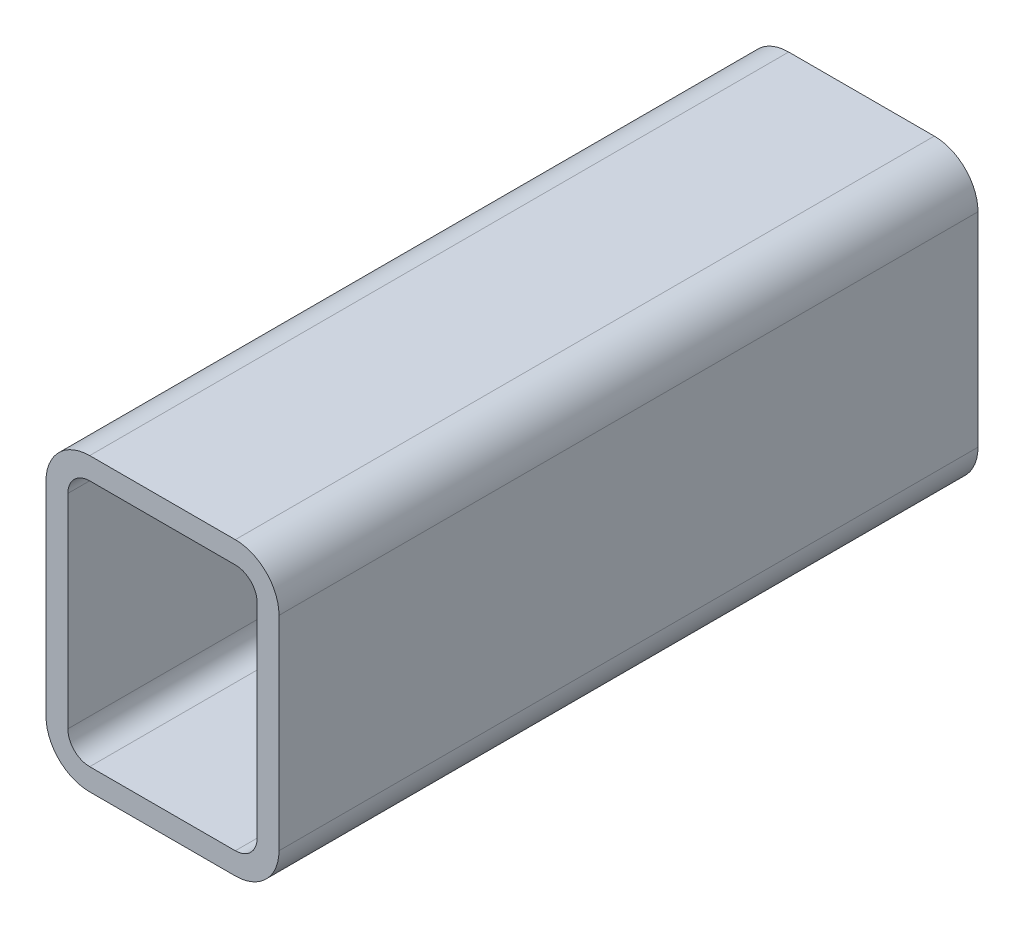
ISO-10303-21;
HEADER;
FILE_DESCRIPTION(('STEP AP214'),'2;1');
FILE_NAME('part.step','',(''),(''),'','','');
FILE_SCHEMA(('AUTOMOTIVE_DESIGN { 1 0 10303 214 1 1 1 1 }'));
ENDSEC;
DATA;
#1=APPLICATION_CONTEXT('core data for automotive mechanical design processes');
#2=APPLICATION_PROTOCOL_DEFINITION('international standard','automotive_design',2000,#1);
#3=PRODUCT_CONTEXT('',#1,'mechanical');
#4=PRODUCT('Part','Part','',(#3));
#5=PRODUCT_RELATED_PRODUCT_CATEGORY('part','',(#4));
#6=PRODUCT_DEFINITION_FORMATION('','',#4);
#7=PRODUCT_DEFINITION_CONTEXT('part definition',#1,'design');
#8=PRODUCT_DEFINITION('design','',#6,#7);
#9=PRODUCT_DEFINITION_SHAPE('','',#8);
#10=(LENGTH_UNIT() NAMED_UNIT(*) SI_UNIT(.MILLI.,.METRE.));
#11=(NAMED_UNIT(*) PLANE_ANGLE_UNIT() SI_UNIT($,.RADIAN.));
#12=(NAMED_UNIT(*) SI_UNIT($,.STERADIAN.) SOLID_ANGLE_UNIT());
#13=UNCERTAINTY_MEASURE_WITH_UNIT(LENGTH_MEASURE(1.E-05),#10,'distance_accuracy_value','');
#14=(GEOMETRIC_REPRESENTATION_CONTEXT(3) GLOBAL_UNCERTAINTY_ASSIGNED_CONTEXT((#13)) GLOBAL_UNIT_ASSIGNED_CONTEXT((#10,
#11,#12)) REPRESENTATION_CONTEXT('',''));
#15=CARTESIAN_POINT('',(0.,0.,0.));
#16=DIRECTION('',(0.,0.,1.));
#17=DIRECTION('',(1.,0.,0.));
#18=AXIS2_PLACEMENT_3D('',#15,#16,#17);
#19=CARTESIAN_POINT('',(20.7251778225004,109.98485662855,304.8));
#20=DIRECTION('',(0.,0.,1.));
#21=DIRECTION('',(1.,0.,0.));
#22=AXIS2_PLACEMENT_3D('',#19,#20,#21);
#23=PLANE('',#22);
#24=CARTESIAN_POINT('',(20.7251778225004,109.98485662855,304.8));
#25=DIRECTION('',(0.,0.,1.));
#26=DIRECTION('',(1.,0.,0.));
#27=AXIS2_PLACEMENT_3D('',#24,#25,#26);
#28=CIRCLE('',#27,19.05);
#29=CARTESIAN_POINT('',(20.7251778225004,129.03485662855,304.8));
#30=VERTEX_POINT('',#29);
#31=CARTESIAN_POINT('',(1.67517782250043,109.98485662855,304.8));
#32=VERTEX_POINT('',#31);
#33=EDGE_CURVE('E211',#30,#32,#28,.T.);
#34=ORIENTED_EDGE('',*,*,#33,.T.);
#35=DIRECTION('',(0.,-1.,0.));
#36=VECTOR('',#35,1.);
#37=CARTESIAN_POINT('',(1.67517782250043,21.08485662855,304.8));
#38=LINE('',#37,#36);
#39=CARTESIAN_POINT('',(1.67517782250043,21.08485662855,304.8));
#40=VERTEX_POINT('',#39);
#41=EDGE_CURVE('E214',#32,#40,#38,.T.);
#42=ORIENTED_EDGE('',*,*,#41,.T.);
#43=CARTESIAN_POINT('',(20.7251778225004,21.08485662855,304.8));
#44=DIRECTION('',(0.,0.,1.));
#45=DIRECTION('',(1.,0.,0.));
#46=AXIS2_PLACEMENT_3D('',#43,#44,#45);
#47=CIRCLE('',#46,19.05);
#48=CARTESIAN_POINT('',(20.7251778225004,2.03485662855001,304.8));
#49=VERTEX_POINT('',#48);
#50=EDGE_CURVE('E217',#40,#49,#47,.T.);
#51=ORIENTED_EDGE('',*,*,#50,.T.);
#52=DIRECTION('',(1.,0.,0.));
#53=VECTOR('',#52,1.);
#54=CARTESIAN_POINT('',(84.2251778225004,2.03485662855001,304.8));
#55=LINE('',#54,#53);
#56=CARTESIAN_POINT('',(84.2251778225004,2.03485662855,304.8));
#57=VERTEX_POINT('',#56);
#58=EDGE_CURVE('E219',#49,#57,#55,.T.);
#59=ORIENTED_EDGE('',*,*,#58,.T.);
#60=CARTESIAN_POINT('',(84.2251778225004,21.08485662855,304.8));
#61=DIRECTION('',(0.,0.,1.));
#62=DIRECTION('',(1.,0.,0.));
#63=AXIS2_PLACEMENT_3D('',#60,#61,#62);
#64=CIRCLE('',#63,19.05);
#65=CARTESIAN_POINT('',(103.2751778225,21.08485662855,304.8));
#66=VERTEX_POINT('',#65);
#67=EDGE_CURVE('E221',#57,#66,#64,.T.);
#68=ORIENTED_EDGE('',*,*,#67,.T.);
#69=DIRECTION('',(0.,1.,0.));
#70=VECTOR('',#69,1.);
#71=CARTESIAN_POINT('',(103.2751778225,109.98485662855,304.8));
#72=LINE('',#71,#70);
#73=CARTESIAN_POINT('',(103.2751778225,109.98485662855,304.8));
#74=VERTEX_POINT('',#73);
#75=EDGE_CURVE('E223',#66,#74,#72,.T.);
#76=ORIENTED_EDGE('',*,*,#75,.T.);
#77=CARTESIAN_POINT('',(84.2251778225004,109.98485662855,304.8));
#78=DIRECTION('',(0.,0.,1.));
#79=DIRECTION('',(1.,0.,0.));
#80=AXIS2_PLACEMENT_3D('',#77,#78,#79);
#81=CIRCLE('',#80,19.05);
#82=CARTESIAN_POINT('',(84.2251778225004,129.03485662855,304.8));
#83=VERTEX_POINT('',#82);
#84=EDGE_CURVE('E225',#74,#83,#81,.T.);
#85=ORIENTED_EDGE('',*,*,#84,.T.);
#86=DIRECTION('',(-1.,0.,0.));
#87=VECTOR('',#86,1.);
#88=CARTESIAN_POINT('',(20.7251778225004,129.03485662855,304.8));
#89=LINE('',#88,#87);
#90=EDGE_CURVE('E227',#83,#30,#89,.T.);
#91=ORIENTED_EDGE('',*,*,#90,.T.);
#92=EDGE_LOOP('',(#34,#42,#51,#59,#68,#76,#85,#91));
#93=FACE_BOUND('',#92,.T.);
#94=DIRECTION('',(0.,-1.,0.));
#95=VECTOR('',#94,1.);
#96=CARTESIAN_POINT('',(11.2001778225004,21.08485662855,304.8));
#97=LINE('',#96,#95);
#98=CARTESIAN_POINT('',(11.2001778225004,109.98485662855,304.8));
#99=VERTEX_POINT('',#98);
#100=CARTESIAN_POINT('',(11.2001778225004,21.08485662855,304.8));
#101=VERTEX_POINT('',#100);
#102=EDGE_CURVE('E154',#99,#101,#97,.T.);
#103=ORIENTED_EDGE('',*,*,#102,.F.);
#104=CARTESIAN_POINT('',(20.7251778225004,109.98485662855,304.8));
#105=DIRECTION('',(0.,0.,1.));
#106=DIRECTION('',(1.,0.,0.));
#107=AXIS2_PLACEMENT_3D('',#104,#105,#106);
#108=CIRCLE('',#107,9.525);
#109=CARTESIAN_POINT('',(20.7251778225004,119.50985662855,304.8));
#110=VERTEX_POINT('',#109);
#111=EDGE_CURVE('E146',#110,#99,#108,.T.);
#112=ORIENTED_EDGE('',*,*,#111,.F.);
#113=DIRECTION('',(-1.,0.,0.));
#114=VECTOR('',#113,1.);
#115=CARTESIAN_POINT('',(20.7251778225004,119.50985662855,304.8));
#116=LINE('',#115,#114);
#117=CARTESIAN_POINT('',(84.2251778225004,119.50985662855,304.8));
#118=VERTEX_POINT('',#117);
#119=EDGE_CURVE('E179',#118,#110,#116,.T.);
#120=ORIENTED_EDGE('',*,*,#119,.F.);
#121=CARTESIAN_POINT('',(84.2251778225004,109.98485662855,304.8));
#122=DIRECTION('',(0.,0.,1.));
#123=DIRECTION('',(1.,0.,0.));
#124=AXIS2_PLACEMENT_3D('',#121,#122,#123);
#125=CIRCLE('',#124,9.525);
#126=CARTESIAN_POINT('',(93.7501778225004,109.98485662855,304.8));
#127=VERTEX_POINT('',#126);
#128=EDGE_CURVE('E177',#127,#118,#125,.T.);
#129=ORIENTED_EDGE('',*,*,#128,.F.);
#130=DIRECTION('',(0.,1.,0.));
#131=VECTOR('',#130,1.);
#132=CARTESIAN_POINT('',(93.7501778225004,109.98485662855,304.8));
#133=LINE('',#132,#131);
#134=CARTESIAN_POINT('',(93.7501778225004,21.08485662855,304.8));
#135=VERTEX_POINT('',#134);
#136=EDGE_CURVE('E175',#135,#127,#133,.T.);
#137=ORIENTED_EDGE('',*,*,#136,.F.);
#138=CARTESIAN_POINT('',(84.2251778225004,21.08485662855,304.8));
#139=DIRECTION('',(0.,0.,1.));
#140=DIRECTION('',(1.,0.,0.));
#141=AXIS2_PLACEMENT_3D('',#138,#139,#140);
#142=CIRCLE('',#141,9.52500000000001);
#143=CARTESIAN_POINT('',(84.2251778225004,11.55985662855,304.8));
#144=VERTEX_POINT('',#143);
#145=EDGE_CURVE('E173',#144,#135,#142,.T.);
#146=ORIENTED_EDGE('',*,*,#145,.F.);
#147=DIRECTION('',(1.,0.,0.));
#148=VECTOR('',#147,1.);
#149=CARTESIAN_POINT('',(84.2251778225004,11.55985662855,304.8));
#150=LINE('',#149,#148);
#151=CARTESIAN_POINT('',(20.7251778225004,11.55985662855,304.8));
#152=VERTEX_POINT('',#151);
#153=EDGE_CURVE('E169',#152,#144,#150,.T.);
#154=ORIENTED_EDGE('',*,*,#153,.F.);
#155=CARTESIAN_POINT('',(20.7251778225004,21.08485662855,304.8));
#156=DIRECTION('',(0.,0.,1.));
#157=DIRECTION('',(1.,0.,0.));
#158=AXIS2_PLACEMENT_3D('',#155,#156,#157);
#159=CIRCLE('',#158,9.525);
#160=EDGE_CURVE('E167',#101,#152,#159,.T.);
#161=ORIENTED_EDGE('',*,*,#160,.F.);
#162=EDGE_LOOP('',(#103,#112,#120,#129,#137,#146,#154,#161));
#163=FACE_BOUND('',#162,.T.);
#164=ADVANCED_FACE('F33',(#93,#163),#23,.T.);
#165=CARTESIAN_POINT('',(20.7251778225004,109.98485662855,0.));
#166=DIRECTION('',(0.,0.,1.));
#167=DIRECTION('',(1.,0.,0.));
#168=AXIS2_PLACEMENT_3D('',#165,#166,#167);
#169=PLANE('',#168);
#170=CARTESIAN_POINT('',(20.7251778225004,109.98485662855,0.));
#171=DIRECTION('',(0.,0.,1.));
#172=DIRECTION('',(1.,0.,0.));
#173=AXIS2_PLACEMENT_3D('',#170,#171,#172);
#174=CIRCLE('',#173,19.05);
#175=CARTESIAN_POINT('',(20.7251778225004,129.03485662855,0.));
#176=VERTEX_POINT('',#175);
#177=CARTESIAN_POINT('',(1.67517782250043,109.98485662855,0.));
#178=VERTEX_POINT('',#177);
#179=EDGE_CURVE('E162',#176,#178,#174,.T.);
#180=ORIENTED_EDGE('',*,*,#179,.F.);
#181=DIRECTION('',(-1.,0.,0.));
#182=VECTOR('',#181,1.);
#183=CARTESIAN_POINT('',(20.7251778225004,129.03485662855,0.));
#184=LINE('',#183,#182);
#185=CARTESIAN_POINT('',(84.2251778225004,129.03485662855,0.));
#186=VERTEX_POINT('',#185);
#187=EDGE_CURVE('E215',#186,#176,#184,.T.);
#188=ORIENTED_EDGE('',*,*,#187,.F.);
#189=CARTESIAN_POINT('',(84.2251778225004,109.98485662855,0.));
#190=DIRECTION('',(0.,0.,1.));
#191=DIRECTION('',(1.,0.,0.));
#192=AXIS2_PLACEMENT_3D('',#189,#190,#191);
#193=CIRCLE('',#192,19.05);
#194=CARTESIAN_POINT('',(103.2751778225,109.98485662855,0.));
#195=VERTEX_POINT('',#194);
#196=EDGE_CURVE('E242',#195,#186,#193,.T.);
#197=ORIENTED_EDGE('',*,*,#196,.F.);
#198=DIRECTION('',(0.,1.,0.));
#199=VECTOR('',#198,1.);
#200=CARTESIAN_POINT('',(103.2751778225,109.98485662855,0.));
#201=LINE('',#200,#199);
#202=CARTESIAN_POINT('',(103.2751778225,21.08485662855,0.));
#203=VERTEX_POINT('',#202);
#204=EDGE_CURVE('E240',#203,#195,#201,.T.);
#205=ORIENTED_EDGE('',*,*,#204,.F.);
#206=CARTESIAN_POINT('',(84.2251778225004,21.08485662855,0.));
#207=DIRECTION('',(0.,0.,1.));
#208=DIRECTION('',(1.,0.,0.));
#209=AXIS2_PLACEMENT_3D('',#206,#207,#208);
#210=CIRCLE('',#209,19.05);
#211=CARTESIAN_POINT('',(84.2251778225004,2.03485662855,0.));
#212=VERTEX_POINT('',#211);
#213=EDGE_CURVE('E238',#212,#203,#210,.T.);
#214=ORIENTED_EDGE('',*,*,#213,.F.);
#215=DIRECTION('',(1.,0.,0.));
#216=VECTOR('',#215,1.);
#217=CARTESIAN_POINT('',(84.2251778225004,2.03485662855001,0.));
#218=LINE('',#217,#216);
#219=CARTESIAN_POINT('',(20.7251778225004,2.03485662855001,0.));
#220=VERTEX_POINT('',#219);
#221=EDGE_CURVE('E236',#220,#212,#218,.T.);
#222=ORIENTED_EDGE('',*,*,#221,.F.);
#223=CARTESIAN_POINT('',(20.7251778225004,21.08485662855,0.));
#224=DIRECTION('',(0.,0.,1.));
#225=DIRECTION('',(1.,0.,0.));
#226=AXIS2_PLACEMENT_3D('',#223,#224,#225);
#227=CIRCLE('',#226,19.05);
#228=CARTESIAN_POINT('',(1.67517782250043,21.08485662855,0.));
#229=VERTEX_POINT('',#228);
#230=EDGE_CURVE('E234',#229,#220,#227,.T.);
#231=ORIENTED_EDGE('',*,*,#230,.F.);
#232=DIRECTION('',(0.,-1.,0.));
#233=VECTOR('',#232,1.);
#234=CARTESIAN_POINT('',(1.67517782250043,21.08485662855,0.));
#235=LINE('',#234,#233);
#236=EDGE_CURVE('E232',#178,#229,#235,.T.);
#237=ORIENTED_EDGE('',*,*,#236,.F.);
#238=EDGE_LOOP('',(#180,#188,#197,#205,#214,#222,#231,#237));
#239=FACE_BOUND('',#238,.T.);
#240=CARTESIAN_POINT('',(20.7251778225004,109.98485662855,0.));
#241=DIRECTION('',(0.,0.,1.));
#242=DIRECTION('',(1.,0.,0.));
#243=AXIS2_PLACEMENT_3D('',#240,#241,#242);
#244=CIRCLE('',#243,9.525);
#245=CARTESIAN_POINT('',(20.7251778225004,119.50985662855,0.));
#246=VERTEX_POINT('',#245);
#247=CARTESIAN_POINT('',(11.2001778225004,109.98485662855,0.));
#248=VERTEX_POINT('',#247);
#249=EDGE_CURVE('E56',#246,#248,#244,.T.);
#250=ORIENTED_EDGE('',*,*,#249,.T.);
#251=DIRECTION('',(0.,-1.,0.));
#252=VECTOR('',#251,1.);
#253=CARTESIAN_POINT('',(11.2001778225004,21.08485662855,0.));
#254=LINE('',#253,#252);
#255=CARTESIAN_POINT('',(11.2001778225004,21.08485662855,0.));
#256=VERTEX_POINT('',#255);
#257=EDGE_CURVE('E161',#248,#256,#254,.T.);
#258=ORIENTED_EDGE('',*,*,#257,.T.);
#259=CARTESIAN_POINT('',(20.7251778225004,21.08485662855,0.));
#260=DIRECTION('',(0.,0.,1.));
#261=DIRECTION('',(1.,0.,0.));
#262=AXIS2_PLACEMENT_3D('',#259,#260,#261);
#263=CIRCLE('',#262,9.525);
#264=CARTESIAN_POINT('',(20.7251778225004,11.55985662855,0.));
#265=VERTEX_POINT('',#264);
#266=EDGE_CURVE('E183',#256,#265,#263,.T.);
#267=ORIENTED_EDGE('',*,*,#266,.T.);
#268=DIRECTION('',(1.,0.,0.));
#269=VECTOR('',#268,1.);
#270=CARTESIAN_POINT('',(84.2251778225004,11.55985662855,0.));
#271=LINE('',#270,#269);
#272=CARTESIAN_POINT('',(84.2251778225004,11.55985662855,0.));
#273=VERTEX_POINT('',#272);
#274=EDGE_CURVE('E186',#265,#273,#271,.T.);
#275=ORIENTED_EDGE('',*,*,#274,.T.);
#276=CARTESIAN_POINT('',(84.2251778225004,21.08485662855,0.));
#277=DIRECTION('',(0.,0.,1.));
#278=DIRECTION('',(1.,0.,0.));
#279=AXIS2_PLACEMENT_3D('',#276,#277,#278);
#280=CIRCLE('',#279,9.52500000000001);
#281=CARTESIAN_POINT('',(93.7501778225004,21.08485662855,0.));
#282=VERTEX_POINT('',#281);
#283=EDGE_CURVE('E189',#273,#282,#280,.T.);
#284=ORIENTED_EDGE('',*,*,#283,.T.);
#285=DIRECTION('',(0.,1.,0.));
#286=VECTOR('',#285,1.);
#287=CARTESIAN_POINT('',(93.7501778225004,109.98485662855,0.));
#288=LINE('',#287,#286);
#289=CARTESIAN_POINT('',(93.7501778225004,109.98485662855,0.));
#290=VERTEX_POINT('',#289);
#291=EDGE_CURVE('E192',#282,#290,#288,.T.);
#292=ORIENTED_EDGE('',*,*,#291,.T.);
#293=CARTESIAN_POINT('',(84.2251778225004,109.98485662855,0.));
#294=DIRECTION('',(0.,0.,1.));
#295=DIRECTION('',(1.,0.,0.));
#296=AXIS2_PLACEMENT_3D('',#293,#294,#295);
#297=CIRCLE('',#296,9.525);
#298=CARTESIAN_POINT('',(84.2251778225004,119.50985662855,0.));
#299=VERTEX_POINT('',#298);
#300=EDGE_CURVE('E195',#290,#299,#297,.T.);
#301=ORIENTED_EDGE('',*,*,#300,.T.);
#302=DIRECTION('',(-1.,0.,0.));
#303=VECTOR('',#302,1.);
#304=CARTESIAN_POINT('',(20.7251778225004,119.50985662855,0.));
#305=LINE('',#304,#303);
#306=EDGE_CURVE('E155',#299,#246,#305,.T.);
#307=ORIENTED_EDGE('',*,*,#306,.T.);
#308=EDGE_LOOP('',(#250,#258,#267,#275,#284,#292,#301,#307));
#309=FACE_BOUND('',#308,.T.);
#310=ADVANCED_FACE('F272',(#239,#309),#169,.F.);
#311=CARTESIAN_POINT('',(20.7251778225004,109.98485662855,304.8));
#312=DIRECTION('',(0.,0.,-1.));
#313=DIRECTION('',(-1.,0.,0.));
#314=AXIS2_PLACEMENT_3D('',#311,#312,#313);
#315=CYLINDRICAL_SURFACE('',#314,19.05);
#316=ORIENTED_EDGE('',*,*,#179,.T.);
#317=DIRECTION('',(0.,0.,-1.));
#318=VECTOR('',#317,1.);
#319=CARTESIAN_POINT('',(1.67517782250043,109.98485662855,304.8));
#320=LINE('',#319,#318);
#321=EDGE_CURVE('E11',#32,#178,#320,.T.);
#322=ORIENTED_EDGE('',*,*,#321,.F.);
#323=ORIENTED_EDGE('',*,*,#33,.F.);
#324=DIRECTION('',(0.,0.,-1.));
#325=VECTOR('',#324,1.);
#326=CARTESIAN_POINT('',(20.7251778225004,129.03485662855,304.8));
#327=LINE('',#326,#325);
#328=EDGE_CURVE('E229',#30,#176,#327,.T.);
#329=ORIENTED_EDGE('',*,*,#328,.T.);
#330=EDGE_LOOP('',(#316,#322,#323,#329));
#331=FACE_BOUND('',#330,.T.);
#332=ADVANCED_FACE('F35',(#331),#315,.T.);
#333=CARTESIAN_POINT('',(1.67517782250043,21.08485662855,304.8));
#334=DIRECTION('',(1.,0.,0.));
#335=DIRECTION('',(0.,0.,-1.));
#336=AXIS2_PLACEMENT_3D('',#333,#334,#335);
#337=PLANE('',#336);
#338=ORIENTED_EDGE('',*,*,#236,.T.);
#339=DIRECTION('',(0.,0.,-1.));
#340=VECTOR('',#339,1.);
#341=CARTESIAN_POINT('',(1.67517782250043,21.08485662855,304.8));
#342=LINE('',#341,#340);
#343=EDGE_CURVE('E41',#40,#229,#342,.T.);
#344=ORIENTED_EDGE('',*,*,#343,.F.);
#345=ORIENTED_EDGE('',*,*,#41,.F.);
#346=ORIENTED_EDGE('',*,*,#321,.T.);
#347=EDGE_LOOP('',(#338,#344,#345,#346));
#348=FACE_BOUND('',#347,.T.);
#349=ADVANCED_FACE('F289',(#348),#337,.F.);
#350=CARTESIAN_POINT('',(20.7251778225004,21.08485662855,304.8));
#351=DIRECTION('',(0.,0.,-1.));
#352=DIRECTION('',(-1.,0.,0.));
#353=AXIS2_PLACEMENT_3D('',#350,#351,#352);
#354=CYLINDRICAL_SURFACE('',#353,19.05);
#355=ORIENTED_EDGE('',*,*,#230,.T.);
#356=DIRECTION('',(0.,0.,-1.));
#357=VECTOR('',#356,1.);
#358=CARTESIAN_POINT('',(20.7251778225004,2.03485662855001,304.8));
#359=LINE('',#358,#357);
#360=EDGE_CURVE('E259',#49,#220,#359,.T.);
#361=ORIENTED_EDGE('',*,*,#360,.F.);
#362=ORIENTED_EDGE('',*,*,#50,.F.);
#363=ORIENTED_EDGE('',*,*,#343,.T.);
#364=EDGE_LOOP('',(#355,#361,#362,#363));
#365=FACE_BOUND('',#364,.T.);
#366=ADVANCED_FACE('F266',(#365),#354,.T.);
#367=CARTESIAN_POINT('',(84.2251778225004,2.03485662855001,304.8));
#368=DIRECTION('',(0.,1.,0.));
#369=DIRECTION('',(0.,0.,1.));
#370=AXIS2_PLACEMENT_3D('',#367,#368,#369);
#371=PLANE('',#370);
#372=ORIENTED_EDGE('',*,*,#221,.T.);
#373=DIRECTION('',(0.,0.,-1.));
#374=VECTOR('',#373,1.);
#375=CARTESIAN_POINT('',(84.2251778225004,2.03485662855,304.8));
#376=LINE('',#375,#374);
#377=EDGE_CURVE('E256',#57,#212,#376,.T.);
#378=ORIENTED_EDGE('',*,*,#377,.F.);
#379=ORIENTED_EDGE('',*,*,#58,.F.);
#380=ORIENTED_EDGE('',*,*,#360,.T.);
#381=EDGE_LOOP('',(#372,#378,#379,#380));
#382=FACE_BOUND('',#381,.T.);
#383=ADVANCED_FACE('F278',(#382),#371,.F.);
#384=CARTESIAN_POINT('',(84.2251778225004,21.08485662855,304.8));
#385=DIRECTION('',(0.,0.,-1.));
#386=DIRECTION('',(-1.,0.,0.));
#387=AXIS2_PLACEMENT_3D('',#384,#385,#386);
#388=CYLINDRICAL_SURFACE('',#387,19.05);
#389=ORIENTED_EDGE('',*,*,#213,.T.);
#390=DIRECTION('',(0.,0.,-1.));
#391=VECTOR('',#390,1.);
#392=CARTESIAN_POINT('',(103.2751778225,21.08485662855,304.8));
#393=LINE('',#392,#391);
#394=EDGE_CURVE('E253',#66,#203,#393,.T.);
#395=ORIENTED_EDGE('',*,*,#394,.F.);
#396=ORIENTED_EDGE('',*,*,#67,.F.);
#397=ORIENTED_EDGE('',*,*,#377,.T.);
#398=EDGE_LOOP('',(#389,#395,#396,#397));
#399=FACE_BOUND('',#398,.T.);
#400=ADVANCED_FACE('F282',(#399),#388,.T.);
#401=CARTESIAN_POINT('',(103.2751778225,109.98485662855,304.8));
#402=DIRECTION('',(-1.,0.,0.));
#403=DIRECTION('',(0.,0.,1.));
#404=AXIS2_PLACEMENT_3D('',#401,#402,#403);
#405=PLANE('',#404);
#406=ORIENTED_EDGE('',*,*,#204,.T.);
#407=DIRECTION('',(0.,0.,-1.));
#408=VECTOR('',#407,1.);
#409=CARTESIAN_POINT('',(103.2751778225,109.98485662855,304.8));
#410=LINE('',#409,#408);
#411=EDGE_CURVE('E250',#74,#195,#410,.T.);
#412=ORIENTED_EDGE('',*,*,#411,.F.);
#413=ORIENTED_EDGE('',*,*,#75,.F.);
#414=ORIENTED_EDGE('',*,*,#394,.T.);
#415=EDGE_LOOP('',(#406,#412,#413,#414));
#416=FACE_BOUND('',#415,.T.);
#417=ADVANCED_FACE('F302',(#416),#405,.F.);
#418=CARTESIAN_POINT('',(84.2251778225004,109.98485662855,304.8));
#419=DIRECTION('',(0.,0.,-1.));
#420=DIRECTION('',(-1.,0.,0.));
#421=AXIS2_PLACEMENT_3D('',#418,#419,#420);
#422=CYLINDRICAL_SURFACE('',#421,19.05);
#423=ORIENTED_EDGE('',*,*,#196,.T.);
#424=DIRECTION('',(0.,0.,-1.));
#425=VECTOR('',#424,1.);
#426=CARTESIAN_POINT('',(84.2251778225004,129.03485662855,304.8));
#427=LINE('',#426,#425);
#428=EDGE_CURVE('E247',#83,#186,#427,.T.);
#429=ORIENTED_EDGE('',*,*,#428,.F.);
#430=ORIENTED_EDGE('',*,*,#84,.F.);
#431=ORIENTED_EDGE('',*,*,#411,.T.);
#432=EDGE_LOOP('',(#423,#429,#430,#431));
#433=FACE_BOUND('',#432,.T.);
#434=ADVANCED_FACE('F300',(#433),#422,.T.);
#435=CARTESIAN_POINT('',(20.7251778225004,129.03485662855,304.8));
#436=DIRECTION('',(0.,-1.,0.));
#437=DIRECTION('',(0.,0.,-1.));
#438=AXIS2_PLACEMENT_3D('',#435,#436,#437);
#439=PLANE('',#438);
#440=ORIENTED_EDGE('',*,*,#187,.T.);
#441=ORIENTED_EDGE('',*,*,#328,.F.);
#442=ORIENTED_EDGE('',*,*,#90,.F.);
#443=ORIENTED_EDGE('',*,*,#428,.T.);
#444=EDGE_LOOP('',(#440,#441,#442,#443));
#445=FACE_BOUND('',#444,.T.);
#446=ADVANCED_FACE('F295',(#445),#439,.F.);
#447=CARTESIAN_POINT('',(20.7251778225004,109.98485662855,304.8));
#448=DIRECTION('',(0.,0.,-1.));
#449=DIRECTION('',(-1.,0.,0.));
#450=AXIS2_PLACEMENT_3D('',#447,#448,#449);
#451=CYLINDRICAL_SURFACE('',#450,9.525);
#452=ORIENTED_EDGE('',*,*,#249,.F.);
#453=DIRECTION('',(0.,0.,-1.));
#454=VECTOR('',#453,1.);
#455=CARTESIAN_POINT('',(20.7251778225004,119.50985662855,304.8));
#456=LINE('',#455,#454);
#457=EDGE_CURVE('E150',#110,#246,#456,.T.);
#458=ORIENTED_EDGE('',*,*,#457,.F.);
#459=ORIENTED_EDGE('',*,*,#111,.T.);
#460=DIRECTION('',(0.,0.,-1.));
#461=VECTOR('',#460,1.);
#462=CARTESIAN_POINT('',(11.2001778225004,109.98485662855,304.8));
#463=LINE('',#462,#461);
#464=EDGE_CURVE('E149',#99,#248,#463,.T.);
#465=ORIENTED_EDGE('',*,*,#464,.T.);
#466=EDGE_LOOP('',(#452,#458,#459,#465));
#467=FACE_BOUND('',#466,.T.);
#468=ADVANCED_FACE('F148',(#467),#451,.F.);
#469=CARTESIAN_POINT('',(11.2001778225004,21.08485662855,304.8));
#470=DIRECTION('',(1.,0.,0.));
#471=DIRECTION('',(0.,0.,-1.));
#472=AXIS2_PLACEMENT_3D('',#469,#470,#471);
#473=PLANE('',#472);
#474=ORIENTED_EDGE('',*,*,#257,.F.);
#475=ORIENTED_EDGE('',*,*,#464,.F.);
#476=ORIENTED_EDGE('',*,*,#102,.T.);
#477=DIRECTION('',(0.,0.,-1.));
#478=VECTOR('',#477,1.);
#479=CARTESIAN_POINT('',(11.2001778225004,21.08485662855,304.8));
#480=LINE('',#479,#478);
#481=EDGE_CURVE('E163',#101,#256,#480,.T.);
#482=ORIENTED_EDGE('',*,*,#481,.T.);
#483=EDGE_LOOP('',(#474,#475,#476,#482));
#484=FACE_BOUND('',#483,.T.);
#485=ADVANCED_FACE('F158',(#484),#473,.T.);
#486=CARTESIAN_POINT('',(20.7251778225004,21.08485662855,304.8));
#487=DIRECTION('',(0.,0.,-1.));
#488=DIRECTION('',(-1.,0.,0.));
#489=AXIS2_PLACEMENT_3D('',#486,#487,#488);
#490=CYLINDRICAL_SURFACE('',#489,9.525);
#491=ORIENTED_EDGE('',*,*,#266,.F.);
#492=ORIENTED_EDGE('',*,*,#481,.F.);
#493=ORIENTED_EDGE('',*,*,#160,.T.);
#494=DIRECTION('',(0.,0.,-1.));
#495=VECTOR('',#494,1.);
#496=CARTESIAN_POINT('',(20.7251778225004,11.55985662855,304.8));
#497=LINE('',#496,#495);
#498=EDGE_CURVE('E208',#152,#265,#497,.T.);
#499=ORIENTED_EDGE('',*,*,#498,.T.);
#500=EDGE_LOOP('',(#491,#492,#493,#499));
#501=FACE_BOUND('',#500,.T.);
#502=ADVANCED_FACE('F327',(#501),#490,.F.);
#503=CARTESIAN_POINT('',(84.2251778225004,11.55985662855,304.8));
#504=DIRECTION('',(0.,1.,0.));
#505=DIRECTION('',(0.,0.,1.));
#506=AXIS2_PLACEMENT_3D('',#503,#504,#505);
#507=PLANE('',#506);
#508=ORIENTED_EDGE('',*,*,#274,.F.);
#509=ORIENTED_EDGE('',*,*,#498,.F.);
#510=ORIENTED_EDGE('',*,*,#153,.T.);
#511=DIRECTION('',(0.,0.,-1.));
#512=VECTOR('',#511,1.);
#513=CARTESIAN_POINT('',(84.2251778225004,11.55985662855,304.8));
#514=LINE('',#513,#512);
#515=EDGE_CURVE('E206',#144,#273,#514,.T.);
#516=ORIENTED_EDGE('',*,*,#515,.T.);
#517=EDGE_LOOP('',(#508,#509,#510,#516));
#518=FACE_BOUND('',#517,.T.);
#519=ADVANCED_FACE('F331',(#518),#507,.T.);
#520=CARTESIAN_POINT('',(84.2251778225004,21.08485662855,304.8));
#521=DIRECTION('',(0.,0.,-1.));
#522=DIRECTION('',(-1.,0.,0.));
#523=AXIS2_PLACEMENT_3D('',#520,#521,#522);
#524=CYLINDRICAL_SURFACE('',#523,9.52500000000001);
#525=ORIENTED_EDGE('',*,*,#283,.F.);
#526=ORIENTED_EDGE('',*,*,#515,.F.);
#527=ORIENTED_EDGE('',*,*,#145,.T.);
#528=DIRECTION('',(0.,0.,-1.));
#529=VECTOR('',#528,1.);
#530=CARTESIAN_POINT('',(93.7501778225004,21.08485662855,304.8));
#531=LINE('',#530,#529);
#532=EDGE_CURVE('E204',#135,#282,#531,.T.);
#533=ORIENTED_EDGE('',*,*,#532,.T.);
#534=EDGE_LOOP('',(#525,#526,#527,#533));
#535=FACE_BOUND('',#534,.T.);
#536=ADVANCED_FACE('F337',(#535),#524,.F.);
#537=CARTESIAN_POINT('',(93.7501778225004,109.98485662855,304.8));
#538=DIRECTION('',(-1.,0.,0.));
#539=DIRECTION('',(0.,0.,1.));
#540=AXIS2_PLACEMENT_3D('',#537,#538,#539);
#541=PLANE('',#540);
#542=ORIENTED_EDGE('',*,*,#291,.F.);
#543=ORIENTED_EDGE('',*,*,#532,.F.);
#544=ORIENTED_EDGE('',*,*,#136,.T.);
#545=DIRECTION('',(0.,0.,-1.));
#546=VECTOR('',#545,1.);
#547=CARTESIAN_POINT('',(93.7501778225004,109.98485662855,304.8));
#548=LINE('',#547,#546);
#549=EDGE_CURVE('E202',#127,#290,#548,.T.);
#550=ORIENTED_EDGE('',*,*,#549,.T.);
#551=EDGE_LOOP('',(#542,#543,#544,#550));
#552=FACE_BOUND('',#551,.T.);
#553=ADVANCED_FACE('F341',(#552),#541,.T.);
#554=CARTESIAN_POINT('',(84.2251778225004,109.98485662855,304.8));
#555=DIRECTION('',(0.,0.,-1.));
#556=DIRECTION('',(-1.,0.,0.));
#557=AXIS2_PLACEMENT_3D('',#554,#555,#556);
#558=CYLINDRICAL_SURFACE('',#557,9.525);
#559=ORIENTED_EDGE('',*,*,#300,.F.);
#560=ORIENTED_EDGE('',*,*,#549,.F.);
#561=ORIENTED_EDGE('',*,*,#128,.T.);
#562=DIRECTION('',(0.,0.,-1.));
#563=VECTOR('',#562,1.);
#564=CARTESIAN_POINT('',(84.2251778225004,119.50985662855,304.8));
#565=LINE('',#564,#563);
#566=EDGE_CURVE('E48',#118,#299,#565,.T.);
#567=ORIENTED_EDGE('',*,*,#566,.T.);
#568=EDGE_LOOP('',(#559,#560,#561,#567));
#569=FACE_BOUND('',#568,.T.);
#570=ADVANCED_FACE('F345',(#569),#558,.F.);
#571=CARTESIAN_POINT('',(20.7251778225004,119.50985662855,304.8));
#572=DIRECTION('',(0.,-1.,0.));
#573=DIRECTION('',(0.,0.,-1.));
#574=AXIS2_PLACEMENT_3D('',#571,#572,#573);
#575=PLANE('',#574);
#576=ORIENTED_EDGE('',*,*,#306,.F.);
#577=ORIENTED_EDGE('',*,*,#566,.F.);
#578=ORIENTED_EDGE('',*,*,#119,.T.);
#579=ORIENTED_EDGE('',*,*,#457,.T.);
#580=EDGE_LOOP('',(#576,#577,#578,#579));
#581=FACE_BOUND('',#580,.T.);
#582=ADVANCED_FACE('F349',(#581),#575,.T.);
#583=CLOSED_SHELL('',(#164,#310,#332,#349,#366,#383,#400,#417,#434,#446,#468,#485,#502,#519,
#536,#553,#570,#582));
#584=MANIFOLD_SOLID_BREP('B2',#583);
#585=ADVANCED_BREP_SHAPE_REPRESENTATION('',(#18,#584),#14);
#586=SHAPE_DEFINITION_REPRESENTATION(#9,#585);
ENDSEC;
END-ISO-10303-21;
